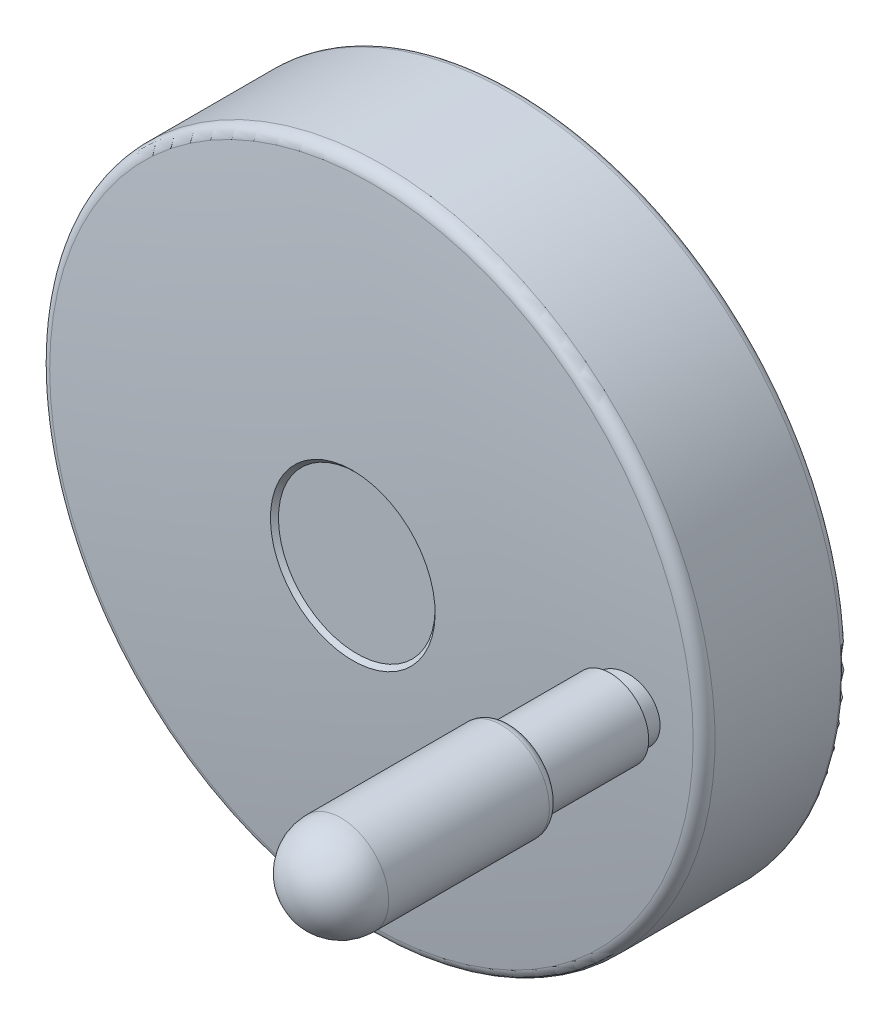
ISO-10303-21;
HEADER;
FILE_DESCRIPTION(('STEP AP214'),'2;1');
FILE_NAME('part.step','',(''),(''),'','','');
FILE_SCHEMA(('AUTOMOTIVE_DESIGN { 1 0 10303 214 1 1 1 1 }'));
ENDSEC;
DATA;
#1=APPLICATION_CONTEXT('core data for automotive mechanical design processes');
#2=APPLICATION_PROTOCOL_DEFINITION('international standard','automotive_design',2000,#1);
#3=PRODUCT_CONTEXT('',#1,'mechanical');
#4=PRODUCT('Part','Part','',(#3));
#5=PRODUCT_RELATED_PRODUCT_CATEGORY('part','',(#4));
#6=PRODUCT_DEFINITION_FORMATION('','',#4);
#7=PRODUCT_DEFINITION_CONTEXT('part definition',#1,'design');
#8=PRODUCT_DEFINITION('design','',#6,#7);
#9=PRODUCT_DEFINITION_SHAPE('','',#8);
#10=(LENGTH_UNIT() NAMED_UNIT(*) SI_UNIT(.MILLI.,.METRE.));
#11=(NAMED_UNIT(*) PLANE_ANGLE_UNIT() SI_UNIT($,.RADIAN.));
#12=(NAMED_UNIT(*) SI_UNIT($,.STERADIAN.) SOLID_ANGLE_UNIT());
#13=UNCERTAINTY_MEASURE_WITH_UNIT(LENGTH_MEASURE(1.E-05),#10,'distance_accuracy_value','');
#14=(GEOMETRIC_REPRESENTATION_CONTEXT(3) GLOBAL_UNCERTAINTY_ASSIGNED_CONTEXT((#13)) GLOBAL_UNIT_ASSIGNED_CONTEXT((#10,
#11,#12)) REPRESENTATION_CONTEXT('',''));
#15=CARTESIAN_POINT('',(0.,0.,0.));
#16=DIRECTION('',(0.,0.,1.));
#17=DIRECTION('',(1.,0.,0.));
#18=AXIS2_PLACEMENT_3D('',#15,#16,#17);
#19=CARTESIAN_POINT('',(0.,0.,42.));
#20=DIRECTION('',(0.,0.,1.));
#21=DIRECTION('',(0.,1.,0.));
#22=AXIS2_PLACEMENT_3D('',#19,#20,#21);
#23=PLANE('',#22);
#24=CARTESIAN_POINT('',(49.,0.,42.));
#25=DIRECTION('',(0.,0.,1.));
#26=DIRECTION('',(0.,1.,0.));
#27=AXIS2_PLACEMENT_3D('',#24,#25,#26);
#28=CIRCLE('',#27,5.4375);
#29=CARTESIAN_POINT('',(49.,5.43749999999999,42.));
#30=VERTEX_POINT('',#29);
#31=EDGE_CURVE('E329',#30,#30,#28,.T.);
#32=ORIENTED_EDGE('',*,*,#31,.F.);
#33=EDGE_LOOP('',(#32));
#34=FACE_BOUND('',#33,.T.);
#35=CARTESIAN_POINT('',(49.,0.,42.));
#36=DIRECTION('',(0.,0.,-1.));
#37=DIRECTION('',(0.,-1.,0.));
#38=AXIS2_PLACEMENT_3D('',#35,#36,#37);
#39=CIRCLE('',#38,6.);
#40=CARTESIAN_POINT('',(49.,-6.,42.));
#41=VERTEX_POINT('',#40);
#42=EDGE_CURVE('E385',#41,#41,#39,.T.);
#43=ORIENTED_EDGE('',*,*,#42,.F.);
#44=EDGE_LOOP('',(#43));
#45=FACE_BOUND('',#44,.T.);
#46=ADVANCED_FACE('F16',(#34,#45),#23,.T.);
#47=CARTESIAN_POINT('',(49.,0.,38.));
#48=DIRECTION('',(0.,0.,-1.));
#49=DIRECTION('',(0.,-1.,0.));
#50=AXIS2_PLACEMENT_3D('',#47,#48,#49);
#51=CYLINDRICAL_SURFACE('',#50,6.);
#52=CARTESIAN_POINT('',(43.,0.,40.1107074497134));
#53=CARTESIAN_POINT('',(43.0000009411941,0.167835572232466,40.1107073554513));
#54=CARTESIAN_POINT('',(43.0070482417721,0.335701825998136,40.110000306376));
#55=CARTESIAN_POINT('',(43.035192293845,0.670274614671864,40.1071766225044));
#56=CARTESIAN_POINT('',(43.0562932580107,0.836980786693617,40.1050595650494));
#57=CARTESIAN_POINT('',(43.1124381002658,1.16828288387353,40.0994264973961));
#58=CARTESIAN_POINT('',(43.1475041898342,1.33287501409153,40.095908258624));
#59=CARTESIAN_POINT('',(43.2313557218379,1.65863013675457,40.0874951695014));
#60=CARTESIAN_POINT('',(43.2801521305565,1.81979027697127,40.0825992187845));
#61=CARTESIAN_POINT('',(43.3909930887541,2.13710869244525,40.0714778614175));
#62=CARTESIAN_POINT('',(43.4530131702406,2.29327560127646,40.065254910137));
#63=CARTESIAN_POINT('',(43.5899340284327,2.5998822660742,40.0515162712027));
#64=CARTESIAN_POINT('',(43.6648406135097,2.75031940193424,40.0440000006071));
#65=CARTESIAN_POINT('',(43.8269764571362,3.04434120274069,40.02773053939));
#66=CARTESIAN_POINT('',(43.9142064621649,3.18792545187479,40.0189772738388));
#67=CARTESIAN_POINT('',(44.1003135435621,3.46716202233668,40.0003014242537));
#68=CARTESIAN_POINT('',(44.1991854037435,3.60281785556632,39.9903793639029));
#69=CARTESIAN_POINT('',(44.4081943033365,3.8656949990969,39.9694040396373));
#70=CARTESIAN_POINT('',(44.5183626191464,3.99289119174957,39.958347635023));
#71=CARTESIAN_POINT('',(44.7488252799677,4.23741820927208,39.9352177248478));
#72=CARTESIAN_POINT('',(44.8691097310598,4.35475845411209,39.9231452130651));
#73=CARTESIAN_POINT('',(45.1190961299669,4.57895044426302,39.8980539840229));
#74=CARTESIAN_POINT('',(45.2488024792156,4.68579723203,39.8850348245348));
#75=CARTESIAN_POINT('',(45.5166911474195,4.88822582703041,39.8581445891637));
#76=CARTESIAN_POINT('',(45.6548754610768,4.9838049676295,39.8442733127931));
#77=CARTESIAN_POINT('',(45.9393374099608,5.16340606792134,39.8157170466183));
#78=CARTESIAN_POINT('',(46.0856479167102,5.24737544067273,39.8010287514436));
#79=CARTESIAN_POINT('',(46.3848184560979,5.40270708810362,39.7709932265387));
#80=CARTESIAN_POINT('',(46.5376808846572,5.47406470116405,39.7556457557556));
#81=CARTESIAN_POINT('',(46.8487652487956,5.60362101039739,39.7244111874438));
#82=CARTESIAN_POINT('',(47.006985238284,5.66182442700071,39.7085242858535));
#83=CARTESIAN_POINT('',(47.3277798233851,5.76472592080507,39.6763116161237));
#84=CARTESIAN_POINT('',(47.4903560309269,5.80941892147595,39.6599856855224));
#85=CARTESIAN_POINT('',(47.8193269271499,5.88511803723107,39.6269486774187));
#86=CARTESIAN_POINT('',(47.985734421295,5.91606794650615,39.6102363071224));
#87=CARTESIAN_POINT('',(48.3206243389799,5.96381333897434,39.5766014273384));
#88=CARTESIAN_POINT('',(48.4891076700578,5.98060239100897,39.5596788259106));
#89=CARTESIAN_POINT('',(48.82688464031,5.99988731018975,39.525750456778));
#90=CARTESIAN_POINT('',(48.996178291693,6.00238296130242,39.5087446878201));
#91=CARTESIAN_POINT('',(49.3342984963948,5.99306555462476,39.4747782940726));
#92=CARTESIAN_POINT('',(49.5031252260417,5.98125895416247,39.4578176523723));
#93=CARTESIAN_POINT('',(49.8396421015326,5.94337840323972,39.4240088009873));
#94=CARTESIAN_POINT('',(50.0073280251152,5.91726655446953,39.4071610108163));
#95=CARTESIAN_POINT('',(50.3398508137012,5.85094280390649,39.3737499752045));
#96=CARTESIAN_POINT('',(50.5046887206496,5.8107361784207,39.3571866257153));
#97=CARTESIAN_POINT('',(50.8304680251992,5.71648072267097,39.3244498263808));
#98=CARTESIAN_POINT('',(50.9914078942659,5.66242655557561,39.3082765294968));
#99=CARTESIAN_POINT('',(51.3081149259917,5.54088114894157,39.276448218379));
#100=CARTESIAN_POINT('',(51.4638839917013,5.47339491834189,39.2607930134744));
#101=CARTESIAN_POINT('',(51.7691010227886,5.32548779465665,39.2301164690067));
#102=CARTESIAN_POINT('',(51.9185528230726,5.24507489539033,39.2150947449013));
#103=CARTESIAN_POINT('',(52.2101278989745,5.07186615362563,39.1857866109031));
#104=CARTESIAN_POINT('',(52.352252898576,4.97907324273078,39.1715000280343));
#105=CARTESIAN_POINT('',(52.6281207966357,4.7817865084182,39.143768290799));
#106=CARTESIAN_POINT('',(52.7618676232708,4.67729823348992,39.1303227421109));
#107=CARTESIAN_POINT('',(53.0202101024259,4.45721140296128,39.1043506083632));
#108=CARTESIAN_POINT('',(53.144796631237,4.34160202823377,39.0918249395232));
#109=CARTESIAN_POINT('',(53.383236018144,4.10071161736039,39.0678518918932));
#110=CARTESIAN_POINT('',(53.4971338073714,3.97547550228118,39.0563999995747));
#111=CARTESIAN_POINT('',(53.7140344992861,3.71571286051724,39.0345909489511));
#112=CARTESIAN_POINT('',(53.8170324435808,3.58118215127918,39.0242342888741));
#113=CARTESIAN_POINT('',(54.0113136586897,3.30384601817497,39.0046983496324));
#114=CARTESIAN_POINT('',(54.1025977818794,3.16104119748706,38.9955189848));
#115=CARTESIAN_POINT('',(54.2727502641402,2.86823346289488,38.9784083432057));
#116=CARTESIAN_POINT('',(54.3516243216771,2.7182338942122,38.9704764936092));
#117=CARTESIAN_POINT('',(54.4961947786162,2.41253808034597,38.9559376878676));
#118=CARTESIAN_POINT('',(54.5619323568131,2.25686150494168,38.949326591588));
#119=CARTESIAN_POINT('',(54.680011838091,1.94060091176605,38.9374513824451));
#120=CARTESIAN_POINT('',(54.732364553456,1.78002097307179,38.9321861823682));
#121=CARTESIAN_POINT('',(54.8232839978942,1.45525129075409,38.9230421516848));
#122=CARTESIAN_POINT('',(54.8618729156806,1.29106781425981,38.9191610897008));
#123=CARTESIAN_POINT('',(54.9250903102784,0.960042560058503,38.9128029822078));
#124=CARTESIAN_POINT('',(54.9497230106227,0.793201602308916,38.9103255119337));
#125=CARTESIAN_POINT('',(54.9781855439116,0.521745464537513,38.9074628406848));
#126=CARTESIAN_POINT('',(54.9863633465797,0.417571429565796,38.9066403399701));
#127=CARTESIAN_POINT('',(54.997270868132,0.208935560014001,38.9055432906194));
#128=CARTESIAN_POINT('',(55.0000005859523,0.104473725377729,38.9052687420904));
#129=CARTESIAN_POINT('',(54.9999990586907,-0.167832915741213,38.905268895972));
#130=CARTESIAN_POINT('',(54.9929519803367,-0.335696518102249,38.9059776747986));
#131=CARTESIAN_POINT('',(54.964808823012,-0.670264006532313,38.9088082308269));
#132=CARTESIAN_POINT('',(54.9437085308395,-0.836967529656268,38.9109304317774));
#133=CARTESIAN_POINT('',(54.8875654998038,-1.16826434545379,38.9165770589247));
#134=CARTESIAN_POINT('',(54.8525005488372,-1.33285384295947,38.9201037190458));
#135=CARTESIAN_POINT('',(54.7686517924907,-1.65860370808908,38.9285366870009));
#136=CARTESIAN_POINT('',(54.7198570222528,-1.81976122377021,38.9334440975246));
#137=CARTESIAN_POINT('',(54.6090199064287,-2.13707433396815,38.9445910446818));
#138=CARTESIAN_POINT('',(54.5470020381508,-2.29323856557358,38.9508281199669));
#139=CARTESIAN_POINT('',(54.4100861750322,-2.59984000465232,38.9645972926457));
#140=CARTESIAN_POINT('',(54.3351823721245,-2.75027459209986,38.9721299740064));
#141=CARTESIAN_POINT('',(54.1730526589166,-3.04429152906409,38.9884340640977));
#142=CARTESIAN_POINT('',(54.0858260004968,-3.18787346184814,38.9972055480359));
#143=CARTESIAN_POINT('',(53.8997261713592,-3.46710571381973,39.0159191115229));
#144=CARTESIAN_POINT('',(53.8008582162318,-3.60275954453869,39.0258606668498));
#145=CARTESIAN_POINT('',(53.5918561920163,-3.86563494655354,39.0468759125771));
#146=CARTESIAN_POINT('',(53.4816906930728,-3.99283127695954,39.0579527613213));
#147=CARTESIAN_POINT('',(53.2512338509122,-4.23735881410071,39.081123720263));
#148=CARTESIAN_POINT('',(53.1309524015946,-4.35469944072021,39.0932168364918));
#149=CARTESIAN_POINT('',(52.8809721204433,-4.57889252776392,39.1183488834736));
#150=CARTESIAN_POINT('',(52.7512688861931,-4.68574002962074,39.131388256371));
#151=CARTESIAN_POINT('',(52.4833864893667,-4.88817043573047,39.158317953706));
#152=CARTESIAN_POINT('',(52.3452053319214,-4.9837506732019,39.1722084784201));
#153=CARTESIAN_POINT('',(52.0607466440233,-5.16335629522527,39.2008021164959));
#154=CARTESIAN_POINT('',(51.9144360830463,-5.24732884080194,39.2155085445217));
#155=CARTESIAN_POINT('',(51.6152650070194,-5.40266673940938,39.2455783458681));
#156=CARTESIAN_POINT('',(51.4624020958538,-5.47402743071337,39.2609419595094));
#157=CARTESIAN_POINT('',(51.1513162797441,-5.6035897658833,39.2922063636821));
#158=CARTESIAN_POINT('',(50.9930953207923,-5.66179612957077,39.3081069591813));
#159=CARTESIAN_POINT('',(50.6722982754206,-5.76470332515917,39.3403442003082));
#160=CARTESIAN_POINT('',(50.5097205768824,-5.80939908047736,39.3566810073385));
#161=CARTESIAN_POINT('',(50.1807455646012,-5.88510357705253,39.3897367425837));
#162=CARTESIAN_POINT('',(50.0143354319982,-5.91605606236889,39.4064569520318));
#163=CARTESIAN_POINT('',(49.679439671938,-5.96380613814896,39.4401041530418));
#164=CARTESIAN_POINT('',(49.5109531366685,-5.98059729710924,39.4570312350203));
#165=CARTESIAN_POINT('',(49.1731692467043,-5.99988585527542,39.4909650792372));
#166=CARTESIAN_POINT('',(49.0038718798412,-6.00238303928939,39.5079718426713));
#167=CARTESIAN_POINT('',(48.6657438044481,-5.99306802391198,39.5419367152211));
#168=CARTESIAN_POINT('',(48.4969129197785,-5.98126228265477,39.5588948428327));
#169=CARTESIAN_POINT('',(48.1603903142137,-5.94338301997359,39.5926949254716));
#170=CARTESIAN_POINT('',(47.992702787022,-5.91727184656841,39.6095364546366));
#171=CARTESIAN_POINT('',(47.6601764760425,-5.85094910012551,39.6429316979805));
#172=CARTESIAN_POINT('',(47.4953366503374,-5.81074280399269,39.6594855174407));
#173=CARTESIAN_POINT('',(47.1695533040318,-5.71648760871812,39.6922002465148));
#174=CARTESIAN_POINT('',(47.0086113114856,-5.66243337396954,39.7083610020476));
#175=CARTESIAN_POINT('',(46.6918999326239,-5.54088740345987,39.7401615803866));
#176=CARTESIAN_POINT('',(46.5361286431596,-5.47340067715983,39.7558015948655));
#177=CARTESIAN_POINT('',(46.230910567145,-5.32549377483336,39.7864452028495));
#178=CARTESIAN_POINT('',(46.0814598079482,-5.24508187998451,39.8014491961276));
#179=CARTESIAN_POINT('',(45.7898866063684,-5.07187528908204,39.8307201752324));
#180=CARTESIAN_POINT('',(45.6477624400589,-4.9790835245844,39.8449873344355));
#181=CARTESIAN_POINT('',(45.3718960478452,-4.78179924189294,39.8726790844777));
#182=CARTESIAN_POINT('',(45.2381498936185,-4.6773122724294,39.8861040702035));
#183=CARTESIAN_POINT('',(44.979808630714,-4.45722824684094,39.9120344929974));
#184=CARTESIAN_POINT('',(44.8552226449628,-4.34162037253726,39.9245390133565));
#185=CARTESIAN_POINT('',(44.6167849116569,-4.10073388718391,39.9484698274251));
#186=CARTESIAN_POINT('',(44.5028881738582,-3.97550025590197,39.9599006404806));
#187=CARTESIAN_POINT('',(44.285989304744,-3.71574294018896,39.9816681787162));
#188=CARTESIAN_POINT('',(44.1829921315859,-3.5812150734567,39.9920044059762));
#189=CARTESIAN_POINT('',(43.9887121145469,-3.30388496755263,40.0115007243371));
#190=CARTESIAN_POINT('',(43.8974284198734,-3.16108333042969,40.0206609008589));
#191=CARTESIAN_POINT('',(43.727276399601,-2.86828230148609,40.0377349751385));
#192=CARTESIAN_POINT('',(43.6484023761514,-2.71828625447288,40.0456494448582));
#193=CARTESIAN_POINT('',(43.5038303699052,-2.41259533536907,40.0601559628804));
#194=CARTESIAN_POINT('',(43.4380914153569,-2.25692003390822,40.0667521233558));
#195=CARTESIAN_POINT('',(43.3200090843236,-1.9406620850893,40.0786001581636));
#196=CARTESIAN_POINT('',(43.2676548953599,-1.78008351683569,40.083853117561));
#197=CARTESIAN_POINT('',(43.1767323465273,-1.45531658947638,40.0929757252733));
#198=CARTESIAN_POINT('',(43.1381418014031,-1.29113449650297,40.0968475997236));
#199=CARTESIAN_POINT('',(43.0749209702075,-0.960111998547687,40.1031906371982));
#200=CARTESIAN_POINT('',(43.0502864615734,-0.793272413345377,40.1056622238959));
#201=CARTESIAN_POINT('',(43.0218195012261,-0.521805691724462,40.108518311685));
#202=CARTESIAN_POINT('',(43.0136398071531,-0.417619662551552,40.1093389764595));
#203=CARTESIAN_POINT('',(43.0027297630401,-0.208959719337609,40.1104335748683));
#204=CARTESIAN_POINT('',(42.9999994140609,-0.104485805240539,40.1107075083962));
#205=CARTESIAN_POINT('',(43.,0.,40.1107074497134));
#206=B_SPLINE_CURVE_WITH_KNOTS('',3,(#52,#53,#54,#55,#56,#57,#58,#59,#60,#61,#62,#63,#64,#65,
#66,#67,#68,#69,#70,#71,#72,#73,#74,#75,#76,#77,#78,#79,#80,#81,#82,#83,#84,#85,#86,#87,#88,#89,
#90,#91,#92,#93,#94,#95,#96,#97,#98,#99,#100,#101,#102,#103,#104,#105,#106,#107,#108,#109,#110,
#111,#112,#113,#114,#115,#116,#117,#118,#119,#120,#121,#122,#123,#124,#125,#126,#127,#128,#129,
#130,#131,#132,#133,#134,#135,#136,#137,#138,#139,#140,#141,#142,#143,#144,#145,#146,#147,#148,
#149,#150,#151,#152,#153,#154,#155,#156,#157,#158,#159,#160,#161,#162,#163,#164,#165,#166,#167,
#168,#169,#170,#171,#172,#173,#174,#175,#176,#177,#178,#179,#180,#181,#182,#183,#184,#185,#186,
#187,#188,#189,#190,#191,#192,#193,#194,#195,#196,#197,#198,#199,#200,#201,#202,#203,#204,#205),
.UNSPECIFIED.,.T.,.F.,(4,2,2,2,2,2,2,2,2,2,2,2,2,2,2,2,2,2,2,2,2,2,2,2,2,2,2,2,2,2,2,2,2,2,2,2,
2,2,2,2,2,2,2,2,2,2,2,2,2,2,2,2,2,2,2,2,2,2,2,2,2,2,2,2,2,2,2,2,2,2,2,2,2,2,2,2,4),(0.,
0.50341075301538,1.00697247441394,1.51133832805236,2.01610816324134,2.51995199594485,
3.02402352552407,3.52812560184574,4.03200266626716,4.5373145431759,5.04213783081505,
5.54719848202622,6.05237842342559,6.55977646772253,7.06736166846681,7.57476443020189,
8.08235761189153,8.59200802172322,9.10188976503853,9.6117792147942,10.1214385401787,
10.6324546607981,11.1432796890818,11.6543018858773,12.1651338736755,12.6756511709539,
13.1860477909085,13.6962032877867,14.2068602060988,14.7152641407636,15.223898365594,
15.7324955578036,16.2408585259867,16.7476020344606,17.2539348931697,17.7594477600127,
18.2648075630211,18.5781689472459,18.8915303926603,19.3949331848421,19.8984869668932,
20.4028449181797,20.9076068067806,21.4114423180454,21.9155055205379,22.419599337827,
22.9234681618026,23.4287788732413,23.9336009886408,24.4386605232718,24.9438393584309,
25.4512469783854,25.9588417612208,26.4662541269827,26.9738569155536,27.4835187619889,
27.9934119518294,28.503312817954,29.0129835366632,29.5240022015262,30.0348297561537,
30.5458544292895,31.0566888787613,31.5671973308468,32.077585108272,32.587731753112,
33.0983797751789,33.6067718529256,34.1153942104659,34.6239796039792,35.1323307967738,
35.6390706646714,36.145399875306,36.6509092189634,37.1562655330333,37.4696631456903,
37.7830608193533),.UNSPECIFIED.);
#207=CARTESIAN_POINT('',(43.,0.,40.1107074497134));
#208=VERTEX_POINT('',#207);
#209=EDGE_CURVE('E356',#208,#208,#206,.T.);
#210=ORIENTED_EDGE('',*,*,#209,.F.);
#211=EDGE_LOOP('',(#210));
#212=FACE_BOUND('',#211,.T.);
#213=ORIENTED_EDGE('',*,*,#42,.T.);
#214=EDGE_LOOP('',(#213));
#215=FACE_BOUND('',#214,.T.);
#216=ADVANCED_FACE('F350',(#212,#215),#51,.T.);
#217=CARTESIAN_POINT('',(0.,0.,-448.281250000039));
#218=DIRECTION('',(-1.,0.,0.));
#219=DIRECTION('',(0.,0.,1.));
#220=AXIS2_PLACEMENT_3D('',#217,#218,#219);
#221=SPHERICAL_SURFACE('',#220,490.281250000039);
#222=CARTESIAN_POINT('',(0.,0.,38.2439407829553));
#223=DIRECTION('',(0.,0.,1.));
#224=DIRECTION('',(0.,1.,0.));
#225=AXIS2_PLACEMENT_3D('',#222,#223,#224);
#226=CIRCLE('',#225,60.571799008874);
#227=CARTESIAN_POINT('',(0.,60.571799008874,38.2439407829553));
#228=VERTEX_POINT('',#227);
#229=EDGE_CURVE('E323',#228,#228,#226,.T.);
#230=ORIENTED_EDGE('',*,*,#229,.T.);
#231=EDGE_LOOP('',(#230));
#232=FACE_BOUND('',#231,.T.);
#233=CARTESIAN_POINT('',(0.,0.,41.7549263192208));
#234=DIRECTION('',(0.,0.,1.));
#235=DIRECTION('',(0.,1.,0.));
#236=AXIS2_PLACEMENT_3D('',#233,#234,#235);
#237=CIRCLE('',#236,15.5);
#238=CARTESIAN_POINT('',(0.,15.5,41.7549263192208));
#239=VERTEX_POINT('',#238);
#240=EDGE_CURVE('E364',#239,#239,#237,.F.);
#241=ORIENTED_EDGE('',*,*,#240,.T.);
#242=EDGE_LOOP('',(#241));
#243=FACE_BOUND('',#242,.T.);
#244=ORIENTED_EDGE('',*,*,#209,.T.);
#245=EDGE_LOOP('',(#244));
#246=FACE_BOUND('',#245,.T.);
#247=ADVANCED_FACE('F344',(#232,#243,#246),#221,.T.);
#248=CARTESIAN_POINT('',(0.,0.,36.0607950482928));
#249=DIRECTION('',(0.,0.,1.));
#250=DIRECTION('',(0.,1.,0.));
#251=AXIS2_PLACEMENT_3D('',#248,#249,#250);
#252=TOROIDAL_SURFACE('',#251,60.3,2.2);
#253=CARTESIAN_POINT('',(0.,0.,36.0607950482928));
#254=DIRECTION('',(0.,0.,1.));
#255=DIRECTION('',(0.,1.,0.));
#256=AXIS2_PLACEMENT_3D('',#253,#254,#255);
#257=CIRCLE('',#256,62.5);
#258=CARTESIAN_POINT('',(0.,62.5,36.0607950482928));
#259=VERTEX_POINT('',#258);
#260=EDGE_CURVE('E365',#259,#259,#257,.T.);
#261=ORIENTED_EDGE('',*,*,#260,.T.);
#262=EDGE_LOOP('',(#261));
#263=FACE_BOUND('',#262,.T.);
#264=ORIENTED_EDGE('',*,*,#229,.F.);
#265=EDGE_LOOP('',(#264));
#266=FACE_BOUND('',#265,.T.);
#267=ADVANCED_FACE('F349',(#263,#266),#252,.T.);
#268=CARTESIAN_POINT('',(0.,0.,41.7549263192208));
#269=DIRECTION('',(0.,0.,1.));
#270=DIRECTION('',(0.,1.,0.));
#271=AXIS2_PLACEMENT_3D('',#268,#269,#270);
#272=CONICAL_SURFACE('',#271,15.5,0.785398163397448);
#273=CARTESIAN_POINT('',(0.,0.,41.));
#274=DIRECTION('',(0.,0.,1.));
#275=DIRECTION('',(0.,1.,0.));
#276=AXIS2_PLACEMENT_3D('',#273,#274,#275);
#277=CIRCLE('',#276,14.7450736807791);
#278=CARTESIAN_POINT('',(0.,14.7450736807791,41.));
#279=VERTEX_POINT('',#278);
#280=EDGE_CURVE('E367',#279,#279,#277,.T.);
#281=ORIENTED_EDGE('',*,*,#280,.F.);
#282=EDGE_LOOP('',(#281));
#283=FACE_BOUND('',#282,.T.);
#284=ORIENTED_EDGE('',*,*,#240,.F.);
#285=EDGE_LOOP('',(#284));
#286=FACE_BOUND('',#285,.T.);
#287=ADVANCED_FACE('F373',(#283,#286),#272,.F.);
#288=CARTESIAN_POINT('',(0.,0.,24.2178975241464));
#289=DIRECTION('',(0.,0.,-1.));
#290=DIRECTION('',(0.,-1.,0.));
#291=AXIS2_PLACEMENT_3D('',#288,#289,#290);
#292=CYLINDRICAL_SURFACE('',#291,62.5);
#293=CARTESIAN_POINT('',(0.,0.,12.375));
#294=DIRECTION('',(0.,0.,-1.));
#295=DIRECTION('',(0.,-1.,0.));
#296=AXIS2_PLACEMENT_3D('',#293,#294,#295);
#297=CIRCLE('',#296,62.5);
#298=CARTESIAN_POINT('',(0.,-62.5,12.375));
#299=VERTEX_POINT('',#298);
#300=EDGE_CURVE('E63',#299,#299,#297,.F.);
#301=ORIENTED_EDGE('',*,*,#300,.T.);
#302=EDGE_LOOP('',(#301));
#303=FACE_BOUND('',#302,.T.);
#304=ORIENTED_EDGE('',*,*,#260,.F.);
#305=EDGE_LOOP('',(#304));
#306=FACE_BOUND('',#305,.T.);
#307=ADVANCED_FACE('F374',(#303,#306),#292,.T.);
#308=CARTESIAN_POINT('',(-7.37253684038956,0.,41.));
#309=DIRECTION('',(0.,0.,1.));
#310=DIRECTION('',(0.,1.,0.));
#311=AXIS2_PLACEMENT_3D('',#308,#309,#310);
#312=PLANE('',#311);
#313=ORIENTED_EDGE('',*,*,#280,.T.);
#314=EDGE_LOOP('',(#313));
#315=FACE_BOUND('',#314,.T.);
#316=ADVANCED_FACE('F84',(#315),#312,.T.);
#317=CARTESIAN_POINT('',(0.,0.,12.375));
#318=DIRECTION('',(0.,0.,1.));
#319=DIRECTION('',(0.,1.,0.));
#320=AXIS2_PLACEMENT_3D('',#317,#318,#319);
#321=TOROIDAL_SURFACE('',#320,61.125,1.375);
#322=ORIENTED_EDGE('',*,*,#300,.F.);
#323=EDGE_LOOP('',(#322));
#324=FACE_BOUND('',#323,.T.);
#325=CARTESIAN_POINT('',(0.,0.,11.));
#326=DIRECTION('',(0.,0.,1.));
#327=DIRECTION('',(0.,-1.,0.));
#328=AXIS2_PLACEMENT_3D('',#325,#326,#327);
#329=CIRCLE('',#328,61.125);
#330=CARTESIAN_POINT('',(0.,-61.125,11.));
#331=VERTEX_POINT('',#330);
#332=CARTESIAN_POINT('',(0.,61.125,11.));
#333=VERTEX_POINT('',#332);
#334=EDGE_CURVE('E53',#331,#333,#329,.T.);
#335=ORIENTED_EDGE('',*,*,#334,.T.);
#336=CARTESIAN_POINT('',(0.,0.,11.));
#337=DIRECTION('',(0.,0.,1.));
#338=DIRECTION('',(0.,1.,0.));
#339=AXIS2_PLACEMENT_3D('',#336,#337,#338);
#340=CIRCLE('',#339,61.125);
#341=CARTESIAN_POINT('',(-61.125,0.,11.));
#342=VERTEX_POINT('',#341);
#343=EDGE_CURVE('E49',#333,#342,#340,.T.);
#344=ORIENTED_EDGE('',*,*,#343,.T.);
#345=CARTESIAN_POINT('',(0.,0.,11.));
#346=DIRECTION('',(0.,0.,1.));
#347=DIRECTION('',(-1.,0.,0.));
#348=AXIS2_PLACEMENT_3D('',#345,#346,#347);
#349=CIRCLE('',#348,61.125);
#350=EDGE_CURVE('E46',#342,#331,#349,.T.);
#351=ORIENTED_EDGE('',*,*,#350,.T.);
#352=EDGE_LOOP('',(#335,#344,#351));
#353=FACE_BOUND('',#352,.T.);
#354=ADVANCED_FACE('F61',(#324,#353),#321,.T.);
#355=CARTESIAN_POINT('',(-60.5625,0.,11.));
#356=DIRECTION('',(0.,0.,-1.));
#357=DIRECTION('',(-1.,0.,0.));
#358=AXIS2_PLACEMENT_3D('',#355,#356,#357);
#359=PLANE('',#358);
#360=CARTESIAN_POINT('',(0.,0.,11.));
#361=DIRECTION('',(0.,0.,-1.));
#362=DIRECTION('',(0.,-1.,0.));
#363=AXIS2_PLACEMENT_3D('',#360,#361,#362);
#364=CIRCLE('',#363,60.);
#365=CARTESIAN_POINT('',(0.,-60.,11.));
#366=VERTEX_POINT('',#365);
#367=EDGE_CURVE('E392',#366,#366,#364,.F.);
#368=ORIENTED_EDGE('',*,*,#367,.T.);
#369=EDGE_LOOP('',(#368));
#370=FACE_BOUND('',#369,.T.);
#371=ORIENTED_EDGE('',*,*,#343,.F.);
#372=ORIENTED_EDGE('',*,*,#334,.F.);
#373=ORIENTED_EDGE('',*,*,#350,.F.);
#374=EDGE_LOOP('',(#371,#372,#373));
#375=FACE_BOUND('',#374,.T.);
#376=ADVANCED_FACE('F52',(#370,#375),#359,.T.);
#377=CARTESIAN_POINT('',(0.,0.,13.9));
#378=DIRECTION('',(0.,0.,-1.));
#379=DIRECTION('',(0.,-1.,0.));
#380=AXIS2_PLACEMENT_3D('',#377,#378,#379);
#381=CYLINDRICAL_SURFACE('',#380,60.);
#382=ORIENTED_EDGE('',*,*,#367,.F.);
#383=EDGE_LOOP('',(#382));
#384=FACE_BOUND('',#383,.T.);
#385=CARTESIAN_POINT('',(0.,0.,16.8));
#386=DIRECTION('',(0.,0.,-1.));
#387=DIRECTION('',(0.,-1.,0.));
#388=AXIS2_PLACEMENT_3D('',#385,#386,#387);
#389=CIRCLE('',#388,60.);
#390=CARTESIAN_POINT('',(0.,-60.,16.8));
#391=VERTEX_POINT('',#390);
#392=EDGE_CURVE('E399',#391,#391,#389,.T.);
#393=ORIENTED_EDGE('',*,*,#392,.F.);
#394=EDGE_LOOP('',(#393));
#395=FACE_BOUND('',#394,.T.);
#396=ADVANCED_FACE('F103',(#384,#395),#381,.F.);
#397=CARTESIAN_POINT('',(49.,0.,31.5));
#398=DIRECTION('',(0.,0.,1.));
#399=DIRECTION('',(0.,1.,0.));
#400=AXIS2_PLACEMENT_3D('',#397,#398,#399);
#401=CYLINDRICAL_SURFACE('',#400,2.4585);
#402=CARTESIAN_POINT('',(49.,0.,29.0719999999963));
#403=DIRECTION('',(0.,0.,1.));
#404=DIRECTION('',(1.,0.,0.));
#405=AXIS2_PLACEMENT_3D('',#402,#403,#404);
#406=CIRCLE('',#405,2.4585);
#407=CARTESIAN_POINT('',(51.4585,0.,29.0719999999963));
#408=VERTEX_POINT('',#407);
#409=EDGE_CURVE('E9',#408,#408,#406,.F.);
#410=ORIENTED_EDGE('',*,*,#409,.F.);
#411=EDGE_LOOP('',(#410));
#412=FACE_BOUND('',#411,.T.);
#413=CARTESIAN_POINT('',(49.,0.,21.5415));
#414=DIRECTION('',(0.,0.,1.));
#415=DIRECTION('',(0.,1.,0.));
#416=AXIS2_PLACEMENT_3D('',#413,#414,#415);
#417=CIRCLE('',#416,2.4585);
#418=CARTESIAN_POINT('',(49.,2.4585,21.5415));
#419=VERTEX_POINT('',#418);
#420=EDGE_CURVE('E395',#419,#419,#417,.T.);
#421=ORIENTED_EDGE('',*,*,#420,.F.);
#422=EDGE_LOOP('',(#421));
#423=FACE_BOUND('',#422,.T.);
#424=ADVANCED_FACE('F119',(#412,#423),#401,.F.);
#425=CARTESIAN_POINT('',(49.,0.,21.0000000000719));
#426=DIRECTION('',(0.,0.,-1.));
#427=DIRECTION('',(0.,-1.,0.));
#428=AXIS2_PLACEMENT_3D('',#425,#426,#427);
#429=CONICAL_SURFACE('',#428,2.99999999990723,0.785398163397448);
#430=ORIENTED_EDGE('',*,*,#420,.T.);
#431=EDGE_LOOP('',(#430));
#432=FACE_BOUND('',#431,.T.);
#433=CARTESIAN_POINT('',(49.,0.,21.000000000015));
#434=DIRECTION('',(0.,0.,-1.));
#435=DIRECTION('',(0.,-1.,0.));
#436=AXIS2_PLACEMENT_3D('',#433,#434,#435);
#437=CIRCLE('',#436,2.99999999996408);
#438=CARTESIAN_POINT('',(49.,-2.99999999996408,21.000000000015));
#439=VERTEX_POINT('',#438);
#440=EDGE_CURVE('E396',#439,#439,#437,.F.);
#441=ORIENTED_EDGE('',*,*,#440,.F.);
#442=EDGE_LOOP('',(#441));
#443=FACE_BOUND('',#442,.T.);
#444=ADVANCED_FACE('F124',(#432,#443),#429,.F.);
#445=CARTESIAN_POINT('',(52.3,0.,21.));
#446=DIRECTION('',(0.,0.,1.));
#447=DIRECTION('',(0.,1.,0.));
#448=AXIS2_PLACEMENT_3D('',#445,#446,#447);
#449=PLANE('',#448);
#450=ORIENTED_EDGE('',*,*,#440,.T.);
#451=EDGE_LOOP('',(#450));
#452=FACE_BOUND('',#451,.T.);
#453=CARTESIAN_POINT('',(49.,0.,21.));
#454=DIRECTION('',(0.,0.,1.));
#455=DIRECTION('',(0.,1.,0.));
#456=AXIS2_PLACEMENT_3D('',#453,#454,#455);
#457=CIRCLE('',#456,3.6);
#458=CARTESIAN_POINT('',(49.,3.6,21.));
#459=VERTEX_POINT('',#458);
#460=EDGE_CURVE('E401',#459,#459,#457,.T.);
#461=ORIENTED_EDGE('',*,*,#460,.F.);
#462=EDGE_LOOP('',(#461));
#463=FACE_BOUND('',#462,.T.);
#464=ADVANCED_FACE('F127',(#452,#463),#449,.F.);
#465=CARTESIAN_POINT('',(49.,0.,10.5));
#466=DIRECTION('',(0.,0.,1.));
#467=DIRECTION('',(0.,1.,0.));
#468=AXIS2_PLACEMENT_3D('',#465,#466,#467);
#469=CYLINDRICAL_SURFACE('',#468,3.6);
#470=CARTESIAN_POINT('',(49.,0.,16.8));
#471=DIRECTION('',(0.,0.,1.));
#472=DIRECTION('',(0.,1.,0.));
#473=AXIS2_PLACEMENT_3D('',#470,#471,#472);
#474=CIRCLE('',#473,3.6);
#475=CARTESIAN_POINT('',(49.,3.6,16.8));
#476=VERTEX_POINT('',#475);
#477=EDGE_CURVE('E405',#476,#476,#474,.T.);
#478=ORIENTED_EDGE('',*,*,#477,.F.);
#479=EDGE_LOOP('',(#478));
#480=FACE_BOUND('',#479,.T.);
#481=ORIENTED_EDGE('',*,*,#460,.T.);
#482=EDGE_LOOP('',(#481));
#483=FACE_BOUND('',#482,.T.);
#484=ADVANCED_FACE('F137',(#480,#483),#469,.F.);
#485=CARTESIAN_POINT('',(-50.2583644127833,0.,16.8));
#486=DIRECTION('',(0.,0.,-1.));
#487=DIRECTION('',(0.,-1.,0.));
#488=AXIS2_PLACEMENT_3D('',#485,#486,#487);
#489=PLANE('',#488);
#490=CARTESIAN_POINT('',(0.,0.,16.8));
#491=DIRECTION('',(0.,0.,-1.));
#492=DIRECTION('',(0.,-1.,0.));
#493=AXIS2_PLACEMENT_3D('',#490,#491,#492);
#494=CIRCLE('',#493,43.5);
#495=CARTESIAN_POINT('',(0.,-43.5,16.8));
#496=VERTEX_POINT('',#495);
#497=EDGE_CURVE('E411',#496,#496,#494,.F.);
#498=ORIENTED_EDGE('',*,*,#497,.T.);
#499=EDGE_LOOP('',(#498));
#500=FACE_BOUND('',#499,.T.);
#501=CARTESIAN_POINT('',(0.,0.,16.8));
#502=DIRECTION('',(0.,0.,1.));
#503=DIRECTION('',(0.,1.,0.));
#504=AXIS2_PLACEMENT_3D('',#501,#502,#503);
#505=CIRCLE('',#504,57.0167288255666);
#506=CARTESIAN_POINT('',(0.,57.0167288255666,16.8));
#507=VERTEX_POINT('',#506);
#508=EDGE_CURVE('E408',#507,#507,#505,.T.);
#509=ORIENTED_EDGE('',*,*,#508,.F.);
#510=EDGE_LOOP('',(#509));
#511=FACE_BOUND('',#510,.T.);
#512=ORIENTED_EDGE('',*,*,#477,.T.);
#513=EDGE_LOOP('',(#512));
#514=FACE_BOUND('',#513,.T.);
#515=ADVANCED_FACE('F146',(#500,#511,#514),#489,.T.);
#516=CARTESIAN_POINT('',(0.,0.,16.8));
#517=DIRECTION('',(0.,0.,-1.));
#518=DIRECTION('',(0.,-1.,0.));
#519=AXIS2_PLACEMENT_3D('',#516,#517,#518);
#520=CONICAL_SURFACE('',#519,43.5,0.785398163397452);
#521=ORIENTED_EDGE('',*,*,#497,.F.);
#522=EDGE_LOOP('',(#521));
#523=FACE_BOUND('',#522,.T.);
#524=CARTESIAN_POINT('',(0.,0.,17.8));
#525=DIRECTION('',(0.,0.,-1.));
#526=DIRECTION('',(-1.,0.,0.));
#527=AXIS2_PLACEMENT_3D('',#524,#525,#526);
#528=CIRCLE('',#527,42.5);
#529=CARTESIAN_POINT('',(-42.5,0.,17.8));
#530=VERTEX_POINT('',#529);
#531=EDGE_CURVE('E414',#530,#530,#528,.T.);
#532=ORIENTED_EDGE('',*,*,#531,.F.);
#533=EDGE_LOOP('',(#532));
#534=FACE_BOUND('',#533,.T.);
#535=ADVANCED_FACE('F151',(#523,#534),#520,.F.);
#536=CARTESIAN_POINT('',(0.,0.,29.4675974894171));
#537=DIRECTION('',(0.,0.,1.));
#538=DIRECTION('',(0.,1.,0.));
#539=AXIS2_PLACEMENT_3D('',#536,#537,#538);
#540=CONICAL_SURFACE('',#539,58.125,0.0872664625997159);
#541=CARTESIAN_POINT('',(0.,0.,29.4675974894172));
#542=DIRECTION('',(0.,0.,-1.));
#543=DIRECTION('',(-1.,0.,0.));
#544=AXIS2_PLACEMENT_3D('',#541,#542,#543);
#545=CIRCLE('',#544,58.125);
#546=CARTESIAN_POINT('',(-58.125,0.,29.4675974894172));
#547=VERTEX_POINT('',#546);
#548=EDGE_CURVE('E404',#547,#547,#545,.T.);
#549=ORIENTED_EDGE('',*,*,#548,.T.);
#550=EDGE_LOOP('',(#549));
#551=FACE_BOUND('',#550,.T.);
#552=ORIENTED_EDGE('',*,*,#508,.T.);
#553=EDGE_LOOP('',(#552));
#554=FACE_BOUND('',#553,.T.);
#555=ADVANCED_FACE('F148',(#551,#554),#540,.T.);
#556=CARTESIAN_POINT('',(0.,0.,23.5575592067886));
#557=DIRECTION('',(0.,0.,-1.));
#558=DIRECTION('',(0.,-1.,0.));
#559=AXIS2_PLACEMENT_3D('',#556,#557,#558);
#560=CYLINDRICAL_SURFACE('',#559,42.5);
#561=ORIENTED_EDGE('',*,*,#531,.T.);
#562=EDGE_LOOP('',(#561));
#563=FACE_BOUND('',#562,.T.);
#564=CARTESIAN_POINT('',(0.,0.,29.3151184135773));
#565=DIRECTION('',(0.,0.,-1.));
#566=DIRECTION('',(0.,-1.,0.));
#567=AXIS2_PLACEMENT_3D('',#564,#565,#566);
#568=CIRCLE('',#567,42.5);
#569=CARTESIAN_POINT('',(0.,-42.5,29.3151184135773));
#570=VERTEX_POINT('',#569);
#571=EDGE_CURVE('E170',#570,#570,#568,.T.);
#572=ORIENTED_EDGE('',*,*,#571,.F.);
#573=EDGE_LOOP('',(#572));
#574=FACE_BOUND('',#573,.T.);
#575=ADVANCED_FACE('F142',(#563,#574),#560,.F.);
#576=CARTESIAN_POINT('',(0.,0.,29.4));
#577=DIRECTION('',(0.,0.,-1.));
#578=DIRECTION('',(0.,-1.,0.));
#579=AXIS2_PLACEMENT_3D('',#576,#577,#578);
#580=CONICAL_SURFACE('',#579,58.8976428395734,1.48352986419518);
#581=CARTESIAN_POINT('',(0.,0.,29.4));
#582=DIRECTION('',(0.,0.,-1.));
#583=DIRECTION('',(-1.,0.,0.));
#584=AXIS2_PLACEMENT_3D('',#581,#582,#583);
#585=CIRCLE('',#584,58.8976428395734);
#586=CARTESIAN_POINT('',(-58.8976428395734,0.,29.4000000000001));
#587=VERTEX_POINT('',#586);
#588=EDGE_CURVE('E400',#587,#587,#585,.T.);
#589=ORIENTED_EDGE('',*,*,#588,.T.);
#590=EDGE_LOOP('',(#589));
#591=FACE_BOUND('',#590,.T.);
#592=ORIENTED_EDGE('',*,*,#548,.F.);
#593=EDGE_LOOP('',(#592));
#594=FACE_BOUND('',#593,.T.);
#595=ADVANCED_FACE('F139',(#591,#594),#580,.F.);
#596=CARTESIAN_POINT('',(0.,0.,29.3151184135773));
#597=DIRECTION('',(0.,0.,1.));
#598=DIRECTION('',(0.,1.,0.));
#599=AXIS2_PLACEMENT_3D('',#596,#597,#598);
#600=TOROIDAL_SURFACE('',#599,40.6666666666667,1.83333333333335);
#601=CARTESIAN_POINT('',(0.,0.,31.1205992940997));
#602=DIRECTION('',(0.,0.,1.));
#603=DIRECTION('',(0.,1.,0.));
#604=AXIS2_PLACEMENT_3D('',#601,#602,#603);
#605=CIRCLE('',#604,40.3483116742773);
#606=CARTESIAN_POINT('',(0.,40.3483116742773,31.1205992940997));
#607=VERTEX_POINT('',#606);
#608=EDGE_CURVE('E172',#607,#607,#605,.F.);
#609=ORIENTED_EDGE('',*,*,#608,.F.);
#610=EDGE_LOOP('',(#609));
#611=FACE_BOUND('',#610,.T.);
#612=ORIENTED_EDGE('',*,*,#571,.T.);
#613=EDGE_LOOP('',(#612));
#614=FACE_BOUND('',#613,.T.);
#615=ADVANCED_FACE('F133',(#611,#614),#600,.F.);
#616=CARTESIAN_POINT('',(0.,0.,16.8));
#617=DIRECTION('',(0.,0.,-1.));
#618=DIRECTION('',(0.,-1.,0.));
#619=AXIS2_PLACEMENT_3D('',#616,#617,#618);
#620=CONICAL_SURFACE('',#619,60.,0.0872664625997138);
#621=ORIENTED_EDGE('',*,*,#392,.T.);
#622=EDGE_LOOP('',(#621));
#623=FACE_BOUND('',#622,.T.);
#624=ORIENTED_EDGE('',*,*,#588,.F.);
#625=EDGE_LOOP('',(#624));
#626=FACE_BOUND('',#625,.T.);
#627=ADVANCED_FACE('F129',(#623,#626),#620,.F.);
#628=CARTESIAN_POINT('',(0.,0.,31.1205992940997));
#629=DIRECTION('',(0.,0.,1.));
#630=DIRECTION('',(0.,1.,0.));
#631=AXIS2_PLACEMENT_3D('',#628,#629,#630);
#632=CONICAL_SURFACE('',#631,40.3483116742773,1.39626340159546);
#633=CARTESIAN_POINT('',(0.,0.,27.2521044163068));
#634=DIRECTION('',(0.,0.,1.));
#635=DIRECTION('',(-1.,0.,0.));
#636=AXIS2_PLACEMENT_3D('',#633,#634,#635);
#637=CIRCLE('',#636,18.4089870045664);
#638=CARTESIAN_POINT('',(-18.4089870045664,0.,27.2521044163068));
#639=VERTEX_POINT('',#638);
#640=EDGE_CURVE('E175',#639,#639,#637,.T.);
#641=ORIENTED_EDGE('',*,*,#640,.T.);
#642=EDGE_LOOP('',(#641));
#643=FACE_BOUND('',#642,.T.);
#644=ORIENTED_EDGE('',*,*,#608,.T.);
#645=EDGE_LOOP('',(#644));
#646=FACE_BOUND('',#645,.T.);
#647=ADVANCED_FACE('F132',(#643,#646),#632,.T.);
#648=CARTESIAN_POINT('',(0.,0.,26.1688158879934));
#649=DIRECTION('',(0.,0.,1.));
#650=DIRECTION('',(0.,1.,0.));
#651=AXIS2_PLACEMENT_3D('',#648,#649,#650);
#652=TOROIDAL_SURFACE('',#651,18.6,1.1);
#653=CARTESIAN_POINT('',(0.,0.,26.1688158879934));
#654=DIRECTION('',(0.,0.,1.));
#655=DIRECTION('',(0.,1.,0.));
#656=AXIS2_PLACEMENT_3D('',#653,#654,#655);
#657=CIRCLE('',#656,17.5);
#658=CARTESIAN_POINT('',(0.,17.5,26.1688158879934));
#659=VERTEX_POINT('',#658);
#660=EDGE_CURVE('E178',#659,#659,#657,.F.);
#661=ORIENTED_EDGE('',*,*,#660,.F.);
#662=EDGE_LOOP('',(#661));
#663=FACE_BOUND('',#662,.T.);
#664=ORIENTED_EDGE('',*,*,#640,.F.);
#665=EDGE_LOOP('',(#664));
#666=FACE_BOUND('',#665,.T.);
#667=ADVANCED_FACE('F182',(#663,#666),#652,.F.);
#668=CARTESIAN_POINT('',(0.,0.,13.1844079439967));
#669=DIRECTION('',(0.,0.,-1.));
#670=DIRECTION('',(0.,-1.,0.));
#671=AXIS2_PLACEMENT_3D('',#668,#669,#670);
#672=CYLINDRICAL_SURFACE('',#671,17.5);
#673=CARTESIAN_POINT('',(0.,0.,0.2));
#674=DIRECTION('',(0.,0.,-1.));
#675=DIRECTION('',(0.,-1.,0.));
#676=AXIS2_PLACEMENT_3D('',#673,#674,#675);
#677=CIRCLE('',#676,17.5);
#678=CARTESIAN_POINT('',(0.,-17.5,0.2));
#679=VERTEX_POINT('',#678);
#680=EDGE_CURVE('E415',#679,#679,#677,.F.);
#681=ORIENTED_EDGE('',*,*,#680,.T.);
#682=EDGE_LOOP('',(#681));
#683=FACE_BOUND('',#682,.T.);
#684=ORIENTED_EDGE('',*,*,#660,.T.);
#685=EDGE_LOOP('',(#684));
#686=FACE_BOUND('',#685,.T.);
#687=ADVANCED_FACE('F185',(#683,#686),#672,.T.);
#688=CARTESIAN_POINT('',(-15.25,0.,0.2));
#689=DIRECTION('',(0.,0.,-1.));
#690=DIRECTION('',(-1.,0.,0.));
#691=AXIS2_PLACEMENT_3D('',#688,#689,#690);
#692=PLANE('',#691);
#693=CARTESIAN_POINT('',(0.,0.,0.2));
#694=DIRECTION('',(0.,0.,-1.));
#695=DIRECTION('',(0.,-1.,0.));
#696=AXIS2_PLACEMENT_3D('',#693,#694,#695);
#697=CIRCLE('',#696,13.);
#698=CARTESIAN_POINT('',(0.,-13.,0.2));
#699=VERTEX_POINT('',#698);
#700=EDGE_CURVE('E418',#699,#699,#697,.F.);
#701=ORIENTED_EDGE('',*,*,#700,.T.);
#702=EDGE_LOOP('',(#701));
#703=FACE_BOUND('',#702,.T.);
#704=ORIENTED_EDGE('',*,*,#680,.F.);
#705=EDGE_LOOP('',(#704));
#706=FACE_BOUND('',#705,.T.);
#707=ADVANCED_FACE('F189',(#703,#706),#692,.T.);
#708=CARTESIAN_POINT('',(0.,0.,0.1));
#709=DIRECTION('',(0.,0.,-1.));
#710=DIRECTION('',(0.,-1.,0.));
#711=AXIS2_PLACEMENT_3D('',#708,#709,#710);
#712=CYLINDRICAL_SURFACE('',#711,13.);
#713=ORIENTED_EDGE('',*,*,#700,.F.);
#714=EDGE_LOOP('',(#713));
#715=FACE_BOUND('',#714,.T.);
#716=CARTESIAN_POINT('',(0.,0.,0.));
#717=DIRECTION('',(0.,0.,-1.));
#718=DIRECTION('',(0.,-1.,0.));
#719=AXIS2_PLACEMENT_3D('',#716,#717,#718);
#720=CIRCLE('',#719,13.);
#721=CARTESIAN_POINT('',(0.,-13.,0.));
#722=VERTEX_POINT('',#721);
#723=EDGE_CURVE('E421',#722,#722,#720,.F.);
#724=ORIENTED_EDGE('',*,*,#723,.T.);
#725=EDGE_LOOP('',(#724));
#726=FACE_BOUND('',#725,.T.);
#727=ADVANCED_FACE('F193',(#715,#726),#712,.T.);
#728=CARTESIAN_POINT('',(-9.7,0.,0.));
#729=DIRECTION('',(0.,0.,-1.));
#730=DIRECTION('',(0.,-1.,0.));
#731=AXIS2_PLACEMENT_3D('',#728,#729,#730);
#732=PLANE('',#731);
#733=CARTESIAN_POINT('',(0.,0.,0.));
#734=DIRECTION('',(0.,0.,-1.));
#735=DIRECTION('',(0.,-1.,0.));
#736=AXIS2_PLACEMENT_3D('',#733,#734,#735);
#737=CIRCLE('',#736,6.39999999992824);
#738=CARTESIAN_POINT('',(0.,-6.39999999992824,0.));
#739=VERTEX_POINT('',#738);
#740=EDGE_CURVE('E424',#739,#739,#737,.F.);
#741=ORIENTED_EDGE('',*,*,#740,.T.);
#742=EDGE_LOOP('',(#741));
#743=FACE_BOUND('',#742,.T.);
#744=ORIENTED_EDGE('',*,*,#723,.F.);
#745=EDGE_LOOP('',(#744));
#746=FACE_BOUND('',#745,.T.);
#747=ADVANCED_FACE('F197',(#743,#746),#732,.T.);
#748=CARTESIAN_POINT('',(0.,0.,5.6843418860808E-11));
#749=DIRECTION('',(0.,0.,-1.));
#750=DIRECTION('',(0.,-1.,0.));
#751=AXIS2_PLACEMENT_3D('',#748,#749,#750);
#752=CONICAL_SURFACE('',#751,6.3999999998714,0.785398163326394);
#753=ORIENTED_EDGE('',*,*,#740,.F.);
#754=EDGE_LOOP('',(#753));
#755=FACE_BOUND('',#754,.T.);
#756=CARTESIAN_POINT('',(0.,0.,0.399999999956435));
#757=DIRECTION('',(0.,0.,-1.));
#758=DIRECTION('',(-1.,0.,0.));
#759=AXIS2_PLACEMENT_3D('',#756,#757,#758);
#760=CIRCLE('',#759,5.99999999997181);
#761=CARTESIAN_POINT('',(-5.99999999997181,0.,0.399999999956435));
#762=VERTEX_POINT('',#761);
#763=EDGE_CURVE('E427',#762,#762,#760,.T.);
#764=ORIENTED_EDGE('',*,*,#763,.F.);
#765=EDGE_LOOP('',(#764));
#766=FACE_BOUND('',#765,.T.);
#767=ADVANCED_FACE('F201',(#755,#766),#752,.F.);
#768=CARTESIAN_POINT('',(0.,0.,13.5));
#769=DIRECTION('',(0.,0.,-1.));
#770=DIRECTION('',(0.,-1.,0.));
#771=AXIS2_PLACEMENT_3D('',#768,#769,#770);
#772=CYLINDRICAL_SURFACE('',#771,6.);
#773=ORIENTED_EDGE('',*,*,#763,.T.);
#774=EDGE_LOOP('',(#773));
#775=FACE_BOUND('',#774,.T.);
#776=CARTESIAN_POINT('',(0.,0.,26.6));
#777=DIRECTION('',(0.,0.,-1.));
#778=DIRECTION('',(0.,-1.,0.));
#779=AXIS2_PLACEMENT_3D('',#776,#777,#778);
#780=CIRCLE('',#779,6.);
#781=CARTESIAN_POINT('',(0.,-6.,26.6));
#782=VERTEX_POINT('',#781);
#783=EDGE_CURVE('E431',#782,#782,#780,.T.);
#784=ORIENTED_EDGE('',*,*,#783,.F.);
#785=EDGE_LOOP('',(#784));
#786=FACE_BOUND('',#785,.T.);
#787=ADVANCED_FACE('F205',(#775,#786),#772,.F.);
#788=CARTESIAN_POINT('',(0.,0.,26.9999999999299));
#789=DIRECTION('',(0.,0.,1.));
#790=DIRECTION('',(0.,1.,0.));
#791=AXIS2_PLACEMENT_3D('',#788,#789,#790);
#792=CONICAL_SURFACE('',#791,6.3999999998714,0.785398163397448);
#793=ORIENTED_EDGE('',*,*,#783,.T.);
#794=EDGE_LOOP('',(#793));
#795=FACE_BOUND('',#794,.T.);
#796=CARTESIAN_POINT('',(0.,0.,27.0000000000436));
#797=DIRECTION('',(0.,0.,1.));
#798=DIRECTION('',(0.,1.,0.));
#799=AXIS2_PLACEMENT_3D('',#796,#797,#798);
#800=CIRCLE('',#799,6.39999999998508);
#801=CARTESIAN_POINT('',(0.,6.39999999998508,27.0000000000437));
#802=VERTEX_POINT('',#801);
#803=EDGE_CURVE('E428',#802,#802,#800,.F.);
#804=ORIENTED_EDGE('',*,*,#803,.F.);
#805=EDGE_LOOP('',(#804));
#806=FACE_BOUND('',#805,.T.);
#807=ADVANCED_FACE('F209',(#795,#806),#792,.F.);
#808=CARTESIAN_POINT('',(-9.2,0.,27.));
#809=DIRECTION('',(0.,0.,1.));
#810=DIRECTION('',(0.,1.,0.));
#811=AXIS2_PLACEMENT_3D('',#808,#809,#810);
#812=PLANE('',#811);
#813=CARTESIAN_POINT('',(0.,0.,27.));
#814=DIRECTION('',(0.,0.,-1.));
#815=DIRECTION('',(0.,-1.,0.));
#816=AXIS2_PLACEMENT_3D('',#813,#814,#815);
#817=CIRCLE('',#816,12.);
#818=CARTESIAN_POINT('',(0.,-12.,27.));
#819=VERTEX_POINT('',#818);
#820=EDGE_CURVE('E432',#819,#819,#817,.F.);
#821=ORIENTED_EDGE('',*,*,#820,.T.);
#822=EDGE_LOOP('',(#821));
#823=FACE_BOUND('',#822,.T.);
#824=ORIENTED_EDGE('',*,*,#803,.T.);
#825=EDGE_LOOP('',(#824));
#826=FACE_BOUND('',#825,.T.);
#827=ADVANCED_FACE('F213',(#823,#826),#812,.T.);
#828=CARTESIAN_POINT('',(0.,0.,28.35));
#829=DIRECTION('',(0.,0.,-1.));
#830=DIRECTION('',(0.,-1.,0.));
#831=AXIS2_PLACEMENT_3D('',#828,#829,#830);
#832=CYLINDRICAL_SURFACE('',#831,12.);
#833=ORIENTED_EDGE('',*,*,#820,.F.);
#834=EDGE_LOOP('',(#833));
#835=FACE_BOUND('',#834,.T.);
#836=CARTESIAN_POINT('',(0.,0.,29.7));
#837=DIRECTION('',(0.,0.,-1.));
#838=DIRECTION('',(0.,-1.,0.));
#839=AXIS2_PLACEMENT_3D('',#836,#837,#838);
#840=CIRCLE('',#839,12.);
#841=CARTESIAN_POINT('',(0.,-12.,29.7));
#842=VERTEX_POINT('',#841);
#843=EDGE_CURVE('E435',#842,#842,#840,.T.);
#844=ORIENTED_EDGE('',*,*,#843,.F.);
#845=EDGE_LOOP('',(#844));
#846=FACE_BOUND('',#845,.T.);
#847=ADVANCED_FACE('F216',(#835,#846),#832,.F.);
#848=CARTESIAN_POINT('',(-6.,0.,29.7));
#849=DIRECTION('',(0.,0.,-1.));
#850=DIRECTION('',(0.,-1.,0.));
#851=AXIS2_PLACEMENT_3D('',#848,#849,#850);
#852=PLANE('',#851);
#853=ORIENTED_EDGE('',*,*,#843,.T.);
#854=EDGE_LOOP('',(#853));
#855=FACE_BOUND('',#854,.T.);
#856=ADVANCED_FACE('F18',(#855),#852,.T.);
#857=CARTESIAN_POINT('',(49.,-1.19325,29.));
#858=DIRECTION('',(0.,0.,-1.));
#859=DIRECTION('',(0.,-1.,0.));
#860=AXIS2_PLACEMENT_3D('',#857,#858,#859);
#861=PLANE('',#860);
#862=CARTESIAN_POINT('',(49.,0.,29.0000000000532));
#863=DIRECTION('',(0.,0.,1.));
#864=DIRECTION('',(1.,0.,0.));
#865=AXIS2_PLACEMENT_3D('',#862,#863,#864);
#866=CIRCLE('',#865,2.3865000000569);
#867=CARTESIAN_POINT('',(51.3865000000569,0.,29.0000000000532));
#868=VERTEX_POINT('',#867);
#869=EDGE_CURVE('E269',#868,#868,#866,.T.);
#870=ORIENTED_EDGE('',*,*,#869,.F.);
#871=EDGE_LOOP('',(#870));
#872=FACE_BOUND('',#871,.T.);
#873=DIRECTION('',(0.,-1.,0.));
#874=VECTOR('',#873,1.);
#875=CARTESIAN_POINT('',(47.5,-0.866025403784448,29.));
#876=LINE('',#875,#874);
#877=CARTESIAN_POINT('',(47.5,0.86602540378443,29.));
#878=VERTEX_POINT('',#877);
#879=CARTESIAN_POINT('',(47.5,-0.866025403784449,29.));
#880=VERTEX_POINT('',#879);
#881=EDGE_CURVE('E294',#878,#880,#876,.T.);
#882=ORIENTED_EDGE('',*,*,#881,.T.);
#883=DIRECTION('',(0.866025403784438,-0.5,0.));
#884=VECTOR('',#883,1.);
#885=CARTESIAN_POINT('',(47.5,-0.866025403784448,29.));
#886=LINE('',#885,#884);
#887=CARTESIAN_POINT('',(49.,-1.73205080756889,29.));
#888=VERTEX_POINT('',#887);
#889=EDGE_CURVE('E270',#880,#888,#886,.T.);
#890=ORIENTED_EDGE('',*,*,#889,.T.);
#891=DIRECTION('',(0.866025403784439,0.5,0.));
#892=VECTOR('',#891,1.);
#893=CARTESIAN_POINT('',(50.5,-0.866025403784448,29.));
#894=LINE('',#893,#892);
#895=CARTESIAN_POINT('',(50.5,-0.866025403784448,29.));
#896=VERTEX_POINT('',#895);
#897=EDGE_CURVE('E291',#888,#896,#894,.T.);
#898=ORIENTED_EDGE('',*,*,#897,.T.);
#899=DIRECTION('',(0.,1.,0.));
#900=VECTOR('',#899,1.);
#901=CARTESIAN_POINT('',(50.5,0.86602540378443,29.));
#902=LINE('',#901,#900);
#903=CARTESIAN_POINT('',(50.5,0.866025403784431,29.));
#904=VERTEX_POINT('',#903);
#905=EDGE_CURVE('E305',#896,#904,#902,.T.);
#906=ORIENTED_EDGE('',*,*,#905,.T.);
#907=DIRECTION('',(-0.866025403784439,0.5,0.));
#908=VECTOR('',#907,1.);
#909=CARTESIAN_POINT('',(49.,1.73205080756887,29.));
#910=LINE('',#909,#908);
#911=CARTESIAN_POINT('',(49.,1.73205080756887,29.));
#912=VERTEX_POINT('',#911);
#913=EDGE_CURVE('E320',#904,#912,#910,.T.);
#914=ORIENTED_EDGE('',*,*,#913,.T.);
#915=DIRECTION('',(-0.866025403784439,-0.5,0.));
#916=VECTOR('',#915,1.);
#917=CARTESIAN_POINT('',(47.5,0.86602540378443,29.));
#918=LINE('',#917,#916);
#919=EDGE_CURVE('E311',#912,#878,#918,.T.);
#920=ORIENTED_EDGE('',*,*,#919,.T.);
#921=EDGE_LOOP('',(#882,#890,#898,#906,#914,#920));
#922=FACE_BOUND('',#921,.T.);
#923=ADVANCED_FACE('F225',(#872,#922),#861,.T.);
#924=CARTESIAN_POINT('',(49.,-1.73205080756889,29.));
#925=DIRECTION('',(-0.5,-0.866025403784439,0.));
#926=DIRECTION('',(0.866025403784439,-0.5,0.));
#927=AXIS2_PLACEMENT_3D('',#924,#925,#926);
#928=PLANE('',#927);
#929=DIRECTION('',(0.,0.,1.));
#930=VECTOR('',#929,1.);
#931=CARTESIAN_POINT('',(49.,-1.73205080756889,29.));
#932=LINE('',#931,#930);
#933=CARTESIAN_POINT('',(49.,-1.73205080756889,32.));
#934=VERTEX_POINT('',#933);
#935=EDGE_CURVE('E276',#888,#934,#932,.T.);
#936=ORIENTED_EDGE('',*,*,#935,.F.);
#937=ORIENTED_EDGE('',*,*,#889,.F.);
#938=DIRECTION('',(0.,0.,1.));
#939=VECTOR('',#938,1.);
#940=CARTESIAN_POINT('',(47.5,-0.866025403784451,29.));
#941=LINE('',#940,#939);
#942=CARTESIAN_POINT('',(47.5,-0.866025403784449,32.));
#943=VERTEX_POINT('',#942);
#944=EDGE_CURVE('E279',#943,#880,#941,.F.);
#945=ORIENTED_EDGE('',*,*,#944,.F.);
#946=DIRECTION('',(0.866025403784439,-0.5,0.));
#947=VECTOR('',#946,1.);
#948=CARTESIAN_POINT('',(49.,-1.73205080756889,32.));
#949=LINE('',#948,#947);
#950=EDGE_CURVE('E273',#934,#943,#949,.F.);
#951=ORIENTED_EDGE('',*,*,#950,.F.);
#952=EDGE_LOOP('',(#936,#937,#945,#951));
#953=FACE_BOUND('',#952,.T.);
#954=ADVANCED_FACE('F533',(#953),#928,.F.);
#955=CARTESIAN_POINT('',(49.,0.,32.));
#956=DIRECTION('',(0.,0.,1.));
#957=DIRECTION('',(0.,1.,0.));
#958=AXIS2_PLACEMENT_3D('',#955,#956,#957);
#959=PLANE('',#958);
#960=ORIENTED_EDGE('',*,*,#950,.T.);
#961=DIRECTION('',(0.,1.,0.));
#962=VECTOR('',#961,1.);
#963=CARTESIAN_POINT('',(47.5,0.,32.));
#964=LINE('',#963,#962);
#965=CARTESIAN_POINT('',(47.5,0.86602540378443,32.));
#966=VERTEX_POINT('',#965);
#967=EDGE_CURVE('E285',#966,#943,#964,.F.);
#968=ORIENTED_EDGE('',*,*,#967,.F.);
#969=DIRECTION('',(-0.866025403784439,-0.5,0.));
#970=VECTOR('',#969,1.);
#971=CARTESIAN_POINT('',(47.5,0.86602540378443,32.));
#972=LINE('',#971,#970);
#973=CARTESIAN_POINT('',(49.,1.73205080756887,32.));
#974=VERTEX_POINT('',#973);
#975=EDGE_CURVE('E308',#966,#974,#972,.F.);
#976=ORIENTED_EDGE('',*,*,#975,.T.);
#977=DIRECTION('',(-0.866025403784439,0.5,0.));
#978=VECTOR('',#977,1.);
#979=CARTESIAN_POINT('',(49.,1.73205080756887,32.));
#980=LINE('',#979,#978);
#981=CARTESIAN_POINT('',(50.5,0.866025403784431,32.));
#982=VERTEX_POINT('',#981);
#983=EDGE_CURVE('E317',#974,#982,#980,.F.);
#984=ORIENTED_EDGE('',*,*,#983,.T.);
#985=DIRECTION('',(0.,1.,0.));
#986=VECTOR('',#985,1.);
#987=CARTESIAN_POINT('',(50.5,0.86602540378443,32.));
#988=LINE('',#987,#986);
#989=CARTESIAN_POINT('',(50.5,-0.866025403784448,32.));
#990=VERTEX_POINT('',#989);
#991=EDGE_CURVE('E299',#982,#990,#988,.F.);
#992=ORIENTED_EDGE('',*,*,#991,.T.);
#993=DIRECTION('',(0.866025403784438,0.5,0.));
#994=VECTOR('',#993,1.);
#995=CARTESIAN_POINT('',(49.,-1.73205080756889,32.));
#996=LINE('',#995,#994);
#997=EDGE_CURVE('E282',#934,#990,#996,.T.);
#998=ORIENTED_EDGE('',*,*,#997,.F.);
#999=EDGE_LOOP('',(#960,#968,#976,#984,#992,#998));
#1000=FACE_BOUND('',#999,.T.);
#1001=ADVANCED_FACE('F544',(#1000),#959,.F.);
#1002=CARTESIAN_POINT('',(50.5,-0.866025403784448,29.));
#1003=DIRECTION('',(0.5,-0.866025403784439,0.));
#1004=DIRECTION('',(0.866025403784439,0.5,0.));
#1005=AXIS2_PLACEMENT_3D('',#1002,#1003,#1004);
#1006=PLANE('',#1005);
#1007=DIRECTION('',(0.,0.,1.));
#1008=VECTOR('',#1007,1.);
#1009=CARTESIAN_POINT('',(50.5,-0.866025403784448,29.));
#1010=LINE('',#1009,#1008);
#1011=EDGE_CURVE('E288',#896,#990,#1010,.T.);
#1012=ORIENTED_EDGE('',*,*,#1011,.F.);
#1013=ORIENTED_EDGE('',*,*,#897,.F.);
#1014=ORIENTED_EDGE('',*,*,#935,.T.);
#1015=ORIENTED_EDGE('',*,*,#997,.T.);
#1016=EDGE_LOOP('',(#1012,#1013,#1014,#1015));
#1017=FACE_BOUND('',#1016,.T.);
#1018=ADVANCED_FACE('F554',(#1017),#1006,.F.);
#1019=CARTESIAN_POINT('',(47.5,-0.866025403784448,29.));
#1020=DIRECTION('',(-1.,0.,0.));
#1021=DIRECTION('',(0.,-1.,0.));
#1022=AXIS2_PLACEMENT_3D('',#1019,#1020,#1021);
#1023=PLANE('',#1022);
#1024=ORIENTED_EDGE('',*,*,#944,.T.);
#1025=ORIENTED_EDGE('',*,*,#881,.F.);
#1026=DIRECTION('',(0.,0.,1.));
#1027=VECTOR('',#1026,1.);
#1028=CARTESIAN_POINT('',(47.5,0.86602540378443,29.));
#1029=LINE('',#1028,#1027);
#1030=EDGE_CURVE('E296',#966,#878,#1029,.F.);
#1031=ORIENTED_EDGE('',*,*,#1030,.F.);
#1032=ORIENTED_EDGE('',*,*,#967,.T.);
#1033=EDGE_LOOP('',(#1024,#1025,#1031,#1032));
#1034=FACE_BOUND('',#1033,.T.);
#1035=ADVANCED_FACE('F564',(#1034),#1023,.F.);
#1036=CARTESIAN_POINT('',(50.5,0.86602540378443,29.));
#1037=DIRECTION('',(1.,0.,0.));
#1038=DIRECTION('',(0.,1.,0.));
#1039=AXIS2_PLACEMENT_3D('',#1036,#1037,#1038);
#1040=PLANE('',#1039);
#1041=DIRECTION('',(0.,0.,1.));
#1042=VECTOR('',#1041,1.);
#1043=CARTESIAN_POINT('',(50.5,0.86602540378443,29.));
#1044=LINE('',#1043,#1042);
#1045=EDGE_CURVE('E302',#904,#982,#1044,.T.);
#1046=ORIENTED_EDGE('',*,*,#1045,.F.);
#1047=ORIENTED_EDGE('',*,*,#905,.F.);
#1048=ORIENTED_EDGE('',*,*,#1011,.T.);
#1049=ORIENTED_EDGE('',*,*,#991,.F.);
#1050=EDGE_LOOP('',(#1046,#1047,#1048,#1049));
#1051=FACE_BOUND('',#1050,.T.);
#1052=ADVANCED_FACE('F574',(#1051),#1040,.F.);
#1053=CARTESIAN_POINT('',(47.5,0.86602540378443,29.));
#1054=DIRECTION('',(-0.5,0.866025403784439,0.));
#1055=DIRECTION('',(-0.866025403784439,-0.5,0.));
#1056=AXIS2_PLACEMENT_3D('',#1053,#1054,#1055);
#1057=PLANE('',#1056);
#1058=ORIENTED_EDGE('',*,*,#1030,.T.);
#1059=ORIENTED_EDGE('',*,*,#919,.F.);
#1060=DIRECTION('',(0.,0.,1.));
#1061=VECTOR('',#1060,1.);
#1062=CARTESIAN_POINT('',(49.,1.73205080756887,29.));
#1063=LINE('',#1062,#1061);
#1064=EDGE_CURVE('E314',#974,#912,#1063,.F.);
#1065=ORIENTED_EDGE('',*,*,#1064,.F.);
#1066=ORIENTED_EDGE('',*,*,#975,.F.);
#1067=EDGE_LOOP('',(#1058,#1059,#1065,#1066));
#1068=FACE_BOUND('',#1067,.T.);
#1069=ADVANCED_FACE('F584',(#1068),#1057,.F.);
#1070=CARTESIAN_POINT('',(49.,1.73205080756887,29.));
#1071=DIRECTION('',(0.5,0.866025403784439,0.));
#1072=DIRECTION('',(-0.866025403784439,0.5,0.));
#1073=AXIS2_PLACEMENT_3D('',#1070,#1071,#1072);
#1074=PLANE('',#1073);
#1075=ORIENTED_EDGE('',*,*,#1064,.T.);
#1076=ORIENTED_EDGE('',*,*,#913,.F.);
#1077=ORIENTED_EDGE('',*,*,#1045,.T.);
#1078=ORIENTED_EDGE('',*,*,#983,.F.);
#1079=EDGE_LOOP('',(#1075,#1076,#1077,#1078));
#1080=FACE_BOUND('',#1079,.T.);
#1081=ADVANCED_FACE('F352',(#1080),#1074,.F.);
#1082=CARTESIAN_POINT('',(49.,0.,29.6134999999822));
#1083=DIRECTION('',(0.,0.,1.));
#1084=DIRECTION('',(1.,0.,0.));
#1085=AXIS2_PLACEMENT_3D('',#1082,#1083,#1084);
#1086=CONICAL_SURFACE('',#1085,2.99999999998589,0.785398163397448);
#1087=ORIENTED_EDGE('',*,*,#869,.T.);
#1088=EDGE_LOOP('',(#1087));
#1089=FACE_BOUND('',#1088,.T.);
#1090=ORIENTED_EDGE('',*,*,#409,.T.);
#1091=EDGE_LOOP('',(#1090));
#1092=FACE_BOUND('',#1091,.T.);
#1093=ADVANCED_FACE('F501',(#1089,#1092),#1086,.T.);
#1094=CARTESIAN_POINT('',(49.,0.,42.15));
#1095=DIRECTION('',(0.,0.,1.));
#1096=DIRECTION('',(0.,1.,0.));
#1097=AXIS2_PLACEMENT_3D('',#1094,#1095,#1096);
#1098=CYLINDRICAL_SURFACE('',#1097,5.4375);
#1099=ORIENTED_EDGE('',*,*,#31,.T.);
#1100=EDGE_LOOP('',(#1099));
#1101=FACE_BOUND('',#1100,.T.);
#1102=CARTESIAN_POINT('',(49.,0.,42.3));
#1103=DIRECTION('',(0.,0.,1.));
#1104=DIRECTION('',(0.,1.,0.));
#1105=AXIS2_PLACEMENT_3D('',#1102,#1103,#1104);
#1106=CIRCLE('',#1105,5.4375);
#1107=CARTESIAN_POINT('',(49.,5.43749999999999,42.3));
#1108=VERTEX_POINT('',#1107);
#1109=EDGE_CURVE('E326',#1108,#1108,#1106,.T.);
#1110=ORIENTED_EDGE('',*,*,#1109,.F.);
#1111=EDGE_LOOP('',(#1110));
#1112=FACE_BOUND('',#1111,.T.);
#1113=ADVANCED_FACE('F227',(#1101,#1112),#1098,.T.);
#1114=CARTESIAN_POINT('',(49.,-6.34375,42.3));
#1115=DIRECTION('',(0.,0.,-1.));
#1116=DIRECTION('',(0.,-1.,0.));
#1117=AXIS2_PLACEMENT_3D('',#1114,#1115,#1116);
#1118=PLANE('',#1117);
#1119=CARTESIAN_POINT('',(49.,0.,42.3));
#1120=DIRECTION('',(0.,0.,1.));
#1121=DIRECTION('',(0.,1.,0.));
#1122=AXIS2_PLACEMENT_3D('',#1119,#1120,#1121);
#1123=CIRCLE('',#1122,7.25);
#1124=CARTESIAN_POINT('',(49.,7.24999999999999,42.3));
#1125=VERTEX_POINT('',#1124);
#1126=EDGE_CURVE('E261',#1125,#1125,#1123,.T.);
#1127=ORIENTED_EDGE('',*,*,#1126,.F.);
#1128=EDGE_LOOP('',(#1127));
#1129=FACE_BOUND('',#1128,.T.);
#1130=ORIENTED_EDGE('',*,*,#1109,.T.);
#1131=EDGE_LOOP('',(#1130));
#1132=FACE_BOUND('',#1131,.T.);
#1133=ADVANCED_FACE('F619',(#1129,#1132),#1118,.T.);
#1134=CARTESIAN_POINT('',(49.,0.,51.65));
#1135=DIRECTION('',(0.,0.,1.));
#1136=DIRECTION('',(0.,1.,0.));
#1137=AXIS2_PLACEMENT_3D('',#1134,#1135,#1136);
#1138=CYLINDRICAL_SURFACE('',#1137,7.25);
#1139=ORIENTED_EDGE('',*,*,#1126,.T.);
#1140=EDGE_LOOP('',(#1139));
#1141=FACE_BOUND('',#1140,.T.);
#1142=CARTESIAN_POINT('',(49.,0.,61.));
#1143=DIRECTION('',(0.,0.,-1.));
#1144=DIRECTION('',(1.,0.,0.));
#1145=AXIS2_PLACEMENT_3D('',#1142,#1143,#1144);
#1146=CIRCLE('',#1145,7.25);
#1147=CARTESIAN_POINT('',(56.25,0.,61.));
#1148=VERTEX_POINT('',#1147);
#1149=EDGE_CURVE('E256',#1148,#1148,#1146,.F.);
#1150=ORIENTED_EDGE('',*,*,#1149,.F.);
#1151=EDGE_LOOP('',(#1150));
#1152=FACE_BOUND('',#1151,.T.);
#1153=ADVANCED_FACE('F247',(#1141,#1152),#1138,.T.);
#1154=CARTESIAN_POINT('',(49.,0.,62.75));
#1155=DIRECTION('',(0.,0.,-1.));
#1156=DIRECTION('',(1.,0.,0.));
#1157=AXIS2_PLACEMENT_3D('',#1154,#1155,#1156);
#1158=TOROIDAL_SURFACE('',#1157,7.25,1.75);
#1159=CARTESIAN_POINT('',(49.,0.,62.75));
#1160=DIRECTION('',(0.,0.,1.));
#1161=DIRECTION('',(0.,1.,0.));
#1162=AXIS2_PLACEMENT_3D('',#1159,#1160,#1161);
#1163=CIRCLE('',#1162,9.);
#1164=CARTESIAN_POINT('',(49.,8.99999999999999,62.75));
#1165=VERTEX_POINT('',#1164);
#1166=EDGE_CURVE('E255',#1165,#1165,#1163,.T.);
#1167=ORIENTED_EDGE('',*,*,#1166,.F.);
#1168=EDGE_LOOP('',(#1167));
#1169=FACE_BOUND('',#1168,.T.);
#1170=ORIENTED_EDGE('',*,*,#1149,.T.);
#1171=EDGE_LOOP('',(#1170));
#1172=FACE_BOUND('',#1171,.T.);
#1173=ADVANCED_FACE('F239',(#1169,#1172),#1158,.T.);
#1174=CARTESIAN_POINT('',(49.,0.,77.875));
#1175=DIRECTION('',(0.,0.,1.));
#1176=DIRECTION('',(0.,1.,0.));
#1177=AXIS2_PLACEMENT_3D('',#1174,#1175,#1176);
#1178=CYLINDRICAL_SURFACE('',#1177,9.);
#1179=CARTESIAN_POINT('',(49.,0.,93.));
#1180=DIRECTION('',(0.,0.,1.));
#1181=DIRECTION('',(0.,1.,0.));
#1182=AXIS2_PLACEMENT_3D('',#1179,#1180,#1181);
#1183=CIRCLE('',#1182,9.);
#1184=CARTESIAN_POINT('',(49.,8.99999999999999,93.));
#1185=VERTEX_POINT('',#1184);
#1186=EDGE_CURVE('E252',#1185,#1185,#1183,.F.);
#1187=ORIENTED_EDGE('',*,*,#1186,.T.);
#1188=EDGE_LOOP('',(#1187));
#1189=FACE_BOUND('',#1188,.T.);
#1190=ORIENTED_EDGE('',*,*,#1166,.T.);
#1191=EDGE_LOOP('',(#1190));
#1192=FACE_BOUND('',#1191,.T.);
#1193=ADVANCED_FACE('F232',(#1189,#1192),#1178,.T.);
#1194=CARTESIAN_POINT('',(49.,0.,93.));
#1195=DIRECTION('',(0.,0.,1.));
#1196=DIRECTION('',(0.,-1.,0.));
#1197=AXIS2_PLACEMENT_3D('',#1194,#1195,#1196);
#1198=SPHERICAL_SURFACE('',#1197,9.);
#1199=CARTESIAN_POINT('',(49.,0.,102.));
#1200=VERTEX_POINT('',#1199);
#1201=VERTEX_LOOP('',#1200);
#1202=FACE_BOUND('',#1201,.T.);
#1203=ORIENTED_EDGE('',*,*,#1186,.F.);
#1204=EDGE_LOOP('',(#1203));
#1205=FACE_BOUND('',#1204,.T.);
#1206=ADVANCED_FACE('F230',(#1202,#1205),#1198,.T.);
#1207=CLOSED_SHELL('',(#46,#216,#247,#267,#287,#307,#316,#354,#376,#396,#424,#444,#464,#484,
#515,#535,#555,#575,#595,#615,#627,#647,#667,#687,#707,#727,#747,#767,#787,#807,#827,#847,#856,
#923,#954,#1001,#1018,#1035,#1052,#1069,#1081,#1093,#1113,#1133,#1153,#1173,#1193,#1206));
#1208=CARTESIAN_POINT('',(49.,0.,41.35));
#1209=DIRECTION('',(0.,0.,1.));
#1210=DIRECTION('',(0.,1.,0.));
#1211=AXIS2_PLACEMENT_3D('',#1208,#1209,#1210);
#1212=CYLINDRICAL_SURFACE('',#1211,2.3865);
#1213=CARTESIAN_POINT('',(49.,0.,40.7));
#1214=DIRECTION('',(0.,0.,1.));
#1215=DIRECTION('',(0.,1.,0.));
#1216=AXIS2_PLACEMENT_3D('',#1213,#1214,#1215);
#1217=CIRCLE('',#1216,2.3865);
#1218=CARTESIAN_POINT('',(49.,2.38649999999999,40.7));
#1219=VERTEX_POINT('',#1218);
#1220=EDGE_CURVE('E265',#1219,#1219,#1217,.T.);
#1221=ORIENTED_EDGE('',*,*,#1220,.T.);
#1222=EDGE_LOOP('',(#1221));
#1223=FACE_BOUND('',#1222,.T.);
#1224=CARTESIAN_POINT('',(49.,0.,42.));
#1225=DIRECTION('',(0.,0.,1.));
#1226=DIRECTION('',(0.,1.,0.));
#1227=AXIS2_PLACEMENT_3D('',#1224,#1225,#1226);
#1228=CIRCLE('',#1227,2.3865);
#1229=CARTESIAN_POINT('',(49.,2.38649999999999,42.));
#1230=VERTEX_POINT('',#1229);
#1231=EDGE_CURVE('E268',#1230,#1230,#1228,.T.);
#1232=ORIENTED_EDGE('',*,*,#1231,.F.);
#1233=EDGE_LOOP('',(#1232));
#1234=FACE_BOUND('',#1233,.T.);
#1235=ADVANCED_FACE('F650',(#1223,#1234),#1212,.T.);
#1236=CARTESIAN_POINT('',(49.,-3.912,42.));
#1237=DIRECTION('',(0.,0.,-1.));
#1238=DIRECTION('',(0.,-1.,0.));
#1239=AXIS2_PLACEMENT_3D('',#1236,#1237,#1238);
#1240=PLANE('',#1239);
#1241=ORIENTED_EDGE('',*,*,#1231,.T.);
#1242=EDGE_LOOP('',(#1241));
#1243=FACE_BOUND('',#1242,.T.);
#1244=CARTESIAN_POINT('',(49.,0.,42.));
#1245=DIRECTION('',(0.,0.,-1.));
#1246=DIRECTION('',(0.,-1.,0.));
#1247=AXIS2_PLACEMENT_3D('',#1244,#1245,#1246);
#1248=CIRCLE('',#1247,2.99999999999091);
#1249=CARTESIAN_POINT('',(49.,-2.99999999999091,42.));
#1250=VERTEX_POINT('',#1249);
#1251=EDGE_CURVE('E264',#1250,#1250,#1248,.T.);
#1252=ORIENTED_EDGE('',*,*,#1251,.T.);
#1253=EDGE_LOOP('',(#1252));
#1254=FACE_BOUND('',#1253,.T.);
#1255=ADVANCED_FACE('F654',(#1243,#1254),#1240,.T.);
#1256=CARTESIAN_POINT('',(49.,0.,40.0864999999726));
#1257=DIRECTION('',(0.,0.,-1.));
#1258=DIRECTION('',(0.,-1.,0.));
#1259=AXIS2_PLACEMENT_3D('',#1256,#1257,#1258);
#1260=CONICAL_SURFACE('',#1259,2.99999999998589,0.785398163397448);
#1261=ORIENTED_EDGE('',*,*,#1220,.F.);
#1262=EDGE_LOOP('',(#1261));
#1263=FACE_BOUND('',#1262,.T.);
#1264=CARTESIAN_POINT('',(49.,0.,40.6279999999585));
#1265=DIRECTION('',(0.,0.,-1.));
#1266=DIRECTION('',(0.,-1.,0.));
#1267=AXIS2_PLACEMENT_3D('',#1264,#1265,#1266);
#1268=CIRCLE('',#1267,2.4585);
#1269=CARTESIAN_POINT('',(49.,-2.45850000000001,40.6279999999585));
#1270=VERTEX_POINT('',#1269);
#1271=EDGE_CURVE('E26',#1270,#1270,#1268,.F.);
#1272=ORIENTED_EDGE('',*,*,#1271,.T.);
#1273=EDGE_LOOP('',(#1272));
#1274=FACE_BOUND('',#1273,.T.);
#1275=ADVANCED_FACE('F117',(#1263,#1274),#1260,.T.);
#1276=ORIENTED_EDGE('',*,*,#1271,.F.);
#1277=EDGE_LOOP('',(#1276));
#1278=FACE_BOUND('',#1277,.T.);
#1279=CARTESIAN_POINT('',(49.,0.,41.458500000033));
#1280=DIRECTION('',(0.,0.,1.));
#1281=DIRECTION('',(1.,0.,0.));
#1282=AXIS2_PLACEMENT_3D('',#1279,#1280,#1281);
#1283=CIRCLE('',#1282,2.45850000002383);
#1284=CARTESIAN_POINT('',(51.4585000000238,0.,41.458500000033));
#1285=VERTEX_POINT('',#1284);
#1286=EDGE_CURVE('E57',#1285,#1285,#1283,.T.);
#1287=ORIENTED_EDGE('',*,*,#1286,.T.);
#1288=EDGE_LOOP('',(#1287));
#1289=FACE_BOUND('',#1288,.T.);
#1290=ADVANCED_FACE('F105',(#1278,#1289),#401,.F.);
#1291=CARTESIAN_POINT('',(49.,0.,41.9999999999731));
#1292=DIRECTION('',(0.,0.,1.));
#1293=DIRECTION('',(0.,1.,0.));
#1294=AXIS2_PLACEMENT_3D('',#1291,#1292,#1293);
#1295=CONICAL_SURFACE('',#1294,2.99999999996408,0.785398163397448);
#1296=ORIENTED_EDGE('',*,*,#1251,.F.);
#1297=EDGE_LOOP('',(#1296));
#1298=FACE_BOUND('',#1297,.T.);
#1299=ORIENTED_EDGE('',*,*,#1286,.F.);
#1300=EDGE_LOOP('',(#1299));
#1301=FACE_BOUND('',#1300,.T.);
#1302=ADVANCED_FACE('F87',(#1298,#1301),#1295,.F.);
#1303=CLOSED_SHELL('',(#1235,#1255,#1275,#1290,#1302));
#1304=ORIENTED_CLOSED_SHELL('',*,#1303,.T.);
#1305=BREP_WITH_VOIDS('B1',#1207,(#1304));
#1306=ADVANCED_BREP_SHAPE_REPRESENTATION('',(#18,#1305),#14);
#1307=SHAPE_DEFINITION_REPRESENTATION(#9,#1306);
ENDSEC;
END-ISO-10303-21;
